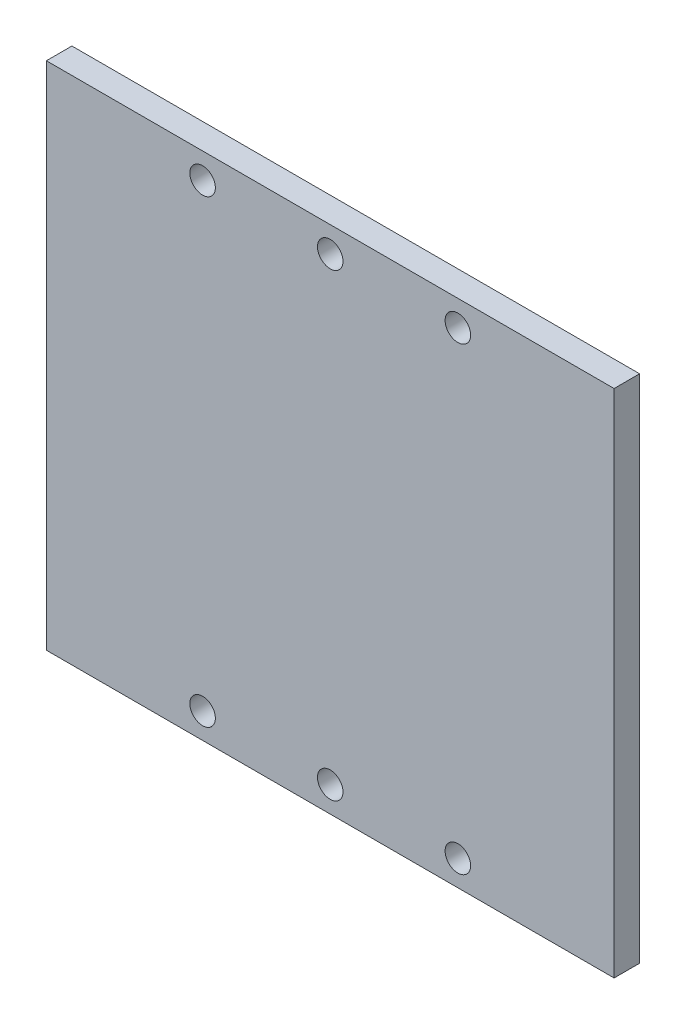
ISO-10303-21;
HEADER;
FILE_DESCRIPTION(('STEP AP214'),'2;1');
FILE_NAME('part.step','',(''),(''),'','','');
FILE_SCHEMA(('AUTOMOTIVE_DESIGN { 1 0 10303 214 1 1 1 1 }'));
ENDSEC;
DATA;
#1=APPLICATION_CONTEXT('core data for automotive mechanical design processes');
#2=APPLICATION_PROTOCOL_DEFINITION('international standard','automotive_design',2000,#1);
#3=PRODUCT_CONTEXT('',#1,'mechanical');
#4=PRODUCT('Part','Part','',(#3));
#5=PRODUCT_RELATED_PRODUCT_CATEGORY('part','',(#4));
#6=PRODUCT_DEFINITION_FORMATION('','',#4);
#7=PRODUCT_DEFINITION_CONTEXT('part definition',#1,'design');
#8=PRODUCT_DEFINITION('design','',#6,#7);
#9=PRODUCT_DEFINITION_SHAPE('','',#8);
#10=(LENGTH_UNIT() NAMED_UNIT(*) SI_UNIT(.MILLI.,.METRE.));
#11=(NAMED_UNIT(*) PLANE_ANGLE_UNIT() SI_UNIT($,.RADIAN.));
#12=(NAMED_UNIT(*) SI_UNIT($,.STERADIAN.) SOLID_ANGLE_UNIT());
#13=UNCERTAINTY_MEASURE_WITH_UNIT(LENGTH_MEASURE(1.E-05),#10,'distance_accuracy_value','');
#14=(GEOMETRIC_REPRESENTATION_CONTEXT(3) GLOBAL_UNCERTAINTY_ASSIGNED_CONTEXT((#13)) GLOBAL_UNIT_ASSIGNED_CONTEXT((#10,
#11,#12)) REPRESENTATION_CONTEXT('',''));
#15=CARTESIAN_POINT('',(0.,0.,0.));
#16=DIRECTION('',(0.,0.,1.));
#17=DIRECTION('',(1.,0.,0.));
#18=AXIS2_PLACEMENT_3D('',#15,#16,#17);
#19=CARTESIAN_POINT('',(0.,0.,2.));
#20=DIRECTION('',(0.,0.,1.));
#21=DIRECTION('',(1.,0.,0.));
#22=AXIS2_PLACEMENT_3D('',#19,#20,#21);
#23=PLANE('',#22);
#24=CARTESIAN_POINT('',(-8.26999999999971,3.00000000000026,2.));
#25=DIRECTION('',(0.,0.,1.));
#26=DIRECTION('',(-1.,0.,0.));
#27=AXIS2_PLACEMENT_3D('',#24,#25,#26);
#28=CIRCLE('',#27,1.);
#29=CARTESIAN_POINT('',(-9.26999999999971,3.00000000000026,2.));
#30=VERTEX_POINT('',#29);
#31=EDGE_CURVE('E165',#30,#30,#28,.T.);
#32=ORIENTED_EDGE('',*,*,#31,.F.);
#33=EDGE_LOOP('',(#32));
#34=FACE_BOUND('',#33,.T.);
#35=CARTESIAN_POINT('',(-18.2699999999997,-32.9999999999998,2.));
#36=DIRECTION('',(0.,0.,1.));
#37=DIRECTION('',(1.,0.,0.));
#38=AXIS2_PLACEMENT_3D('',#35,#36,#37);
#39=CIRCLE('',#38,1.);
#40=CARTESIAN_POINT('',(-17.2699999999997,-32.9999999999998,2.));
#41=VERTEX_POINT('',#40);
#42=EDGE_CURVE('E149',#41,#41,#39,.T.);
#43=ORIENTED_EDGE('',*,*,#42,.F.);
#44=EDGE_LOOP('',(#43));
#45=FACE_BOUND('',#44,.T.);
#46=CARTESIAN_POINT('',(-8.2699999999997,-32.9999999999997,2.));
#47=DIRECTION('',(0.,0.,1.));
#48=DIRECTION('',(1.,0.,0.));
#49=AXIS2_PLACEMENT_3D('',#46,#47,#48);
#50=CIRCLE('',#49,1.);
#51=CARTESIAN_POINT('',(-7.2699999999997,-32.9999999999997,2.));
#52=VERTEX_POINT('',#51);
#53=EDGE_CURVE('E117',#52,#52,#50,.T.);
#54=ORIENTED_EDGE('',*,*,#53,.F.);
#55=EDGE_LOOP('',(#54));
#56=FACE_BOUND('',#55,.T.);
#57=DIRECTION('',(0.,-1.,0.));
#58=VECTOR('',#57,1.);
#59=CARTESIAN_POINT('',(-30.5099999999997,5.00000000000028,2.));
#60=LINE('',#59,#58);
#61=CARTESIAN_POINT('',(-30.5099999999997,5.00000000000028,2.));
#62=VERTEX_POINT('',#61);
#63=CARTESIAN_POINT('',(-30.5099999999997,-34.9999999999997,2.));
#64=VERTEX_POINT('',#63);
#65=EDGE_CURVE('E96',#62,#64,#60,.T.);
#66=ORIENTED_EDGE('',*,*,#65,.T.);
#67=DIRECTION('',(1.,0.,0.));
#68=VECTOR('',#67,1.);
#69=CARTESIAN_POINT('',(-30.5099999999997,-34.9999999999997,2.));
#70=LINE('',#69,#68);
#71=CARTESIAN_POINT('',(13.9700000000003,-34.9999999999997,2.));
#72=VERTEX_POINT('',#71);
#73=EDGE_CURVE('E91',#64,#72,#70,.T.);
#74=ORIENTED_EDGE('',*,*,#73,.T.);
#75=DIRECTION('',(0.,1.,0.));
#76=VECTOR('',#75,1.);
#77=CARTESIAN_POINT('',(13.9700000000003,5.00000000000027,2.));
#78=LINE('',#77,#76);
#79=CARTESIAN_POINT('',(13.9700000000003,5.00000000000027,2.));
#80=VERTEX_POINT('',#79);
#81=EDGE_CURVE('E94',#72,#80,#78,.T.);
#82=ORIENTED_EDGE('',*,*,#81,.T.);
#83=DIRECTION('',(-1.,0.,0.));
#84=VECTOR('',#83,1.);
#85=CARTESIAN_POINT('',(-30.5099999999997,5.00000000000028,2.));
#86=LINE('',#85,#84);
#87=EDGE_CURVE('E61',#80,#62,#86,.T.);
#88=ORIENTED_EDGE('',*,*,#87,.T.);
#89=EDGE_LOOP('',(#66,#74,#82,#88));
#90=FACE_BOUND('',#89,.T.);
#91=CARTESIAN_POINT('',(1.7300000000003,-32.9999999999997,2.));
#92=DIRECTION('',(0.,0.,1.));
#93=DIRECTION('',(1.,0.,0.));
#94=AXIS2_PLACEMENT_3D('',#91,#92,#93);
#95=CIRCLE('',#94,1.);
#96=CARTESIAN_POINT('',(2.7300000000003,-32.9999999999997,2.));
#97=VERTEX_POINT('',#96);
#98=EDGE_CURVE('E141',#97,#97,#95,.T.);
#99=ORIENTED_EDGE('',*,*,#98,.F.);
#100=EDGE_LOOP('',(#99));
#101=FACE_BOUND('',#100,.T.);
#102=CARTESIAN_POINT('',(1.7300000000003,3.00000000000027,2.));
#103=DIRECTION('',(0.,0.,1.));
#104=DIRECTION('',(-1.,0.,0.));
#105=AXIS2_PLACEMENT_3D('',#102,#103,#104);
#106=CIRCLE('',#105,1.);
#107=CARTESIAN_POINT('',(0.730000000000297,3.00000000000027,2.));
#108=VERTEX_POINT('',#107);
#109=EDGE_CURVE('E157',#108,#108,#106,.T.);
#110=ORIENTED_EDGE('',*,*,#109,.F.);
#111=EDGE_LOOP('',(#110));
#112=FACE_BOUND('',#111,.T.);
#113=CARTESIAN_POINT('',(-18.2699999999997,3.00000000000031,2.));
#114=DIRECTION('',(0.,0.,1.));
#115=DIRECTION('',(-1.,0.,0.));
#116=AXIS2_PLACEMENT_3D('',#113,#114,#115);
#117=CIRCLE('',#116,1.);
#118=CARTESIAN_POINT('',(-19.2699999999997,3.00000000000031,2.));
#119=VERTEX_POINT('',#118);
#120=EDGE_CURVE('E173',#119,#119,#117,.T.);
#121=ORIENTED_EDGE('',*,*,#120,.F.);
#122=EDGE_LOOP('',(#121));
#123=FACE_BOUND('',#122,.T.);
#124=ADVANCED_FACE('F43',(#34,#45,#56,#90,#101,#112,#123),#23,.T.);
#125=CARTESIAN_POINT('',(0.,0.,0.));
#126=DIRECTION('',(0.,0.,1.));
#127=DIRECTION('',(1.,0.,0.));
#128=AXIS2_PLACEMENT_3D('',#125,#126,#127);
#129=PLANE('',#128);
#130=DIRECTION('',(0.,-1.,0.));
#131=VECTOR('',#130,1.);
#132=CARTESIAN_POINT('',(-30.5099999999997,5.00000000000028,0.));
#133=LINE('',#132,#131);
#134=CARTESIAN_POINT('',(-30.5099999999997,5.00000000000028,0.));
#135=VERTEX_POINT('',#134);
#136=CARTESIAN_POINT('',(-30.5099999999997,-34.9999999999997,0.));
#137=VERTEX_POINT('',#136);
#138=EDGE_CURVE('E113',#135,#137,#133,.T.);
#139=ORIENTED_EDGE('',*,*,#138,.F.);
#140=DIRECTION('',(-1.,0.,0.));
#141=VECTOR('',#140,1.);
#142=CARTESIAN_POINT('',(-30.5099999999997,5.00000000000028,0.));
#143=LINE('',#142,#141);
#144=CARTESIAN_POINT('',(13.9700000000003,5.00000000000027,0.));
#145=VERTEX_POINT('',#144);
#146=EDGE_CURVE('E84',#145,#135,#143,.T.);
#147=ORIENTED_EDGE('',*,*,#146,.F.);
#148=DIRECTION('',(0.,1.,0.));
#149=VECTOR('',#148,1.);
#150=CARTESIAN_POINT('',(13.9700000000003,5.00000000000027,0.));
#151=LINE('',#150,#149);
#152=CARTESIAN_POINT('',(13.9700000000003,-34.9999999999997,0.));
#153=VERTEX_POINT('',#152);
#154=EDGE_CURVE('E78',#153,#145,#151,.T.);
#155=ORIENTED_EDGE('',*,*,#154,.F.);
#156=DIRECTION('',(1.,0.,0.));
#157=VECTOR('',#156,1.);
#158=CARTESIAN_POINT('',(-30.5099999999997,-34.9999999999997,0.));
#159=LINE('',#158,#157);
#160=EDGE_CURVE('E101',#137,#153,#159,.T.);
#161=ORIENTED_EDGE('',*,*,#160,.F.);
#162=EDGE_LOOP('',(#139,#147,#155,#161));
#163=FACE_BOUND('',#162,.T.);
#164=CARTESIAN_POINT('',(-8.2699999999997,-32.9999999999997,0.));
#165=DIRECTION('',(0.,0.,1.));
#166=DIRECTION('',(1.,0.,0.));
#167=AXIS2_PLACEMENT_3D('',#164,#165,#166);
#168=CIRCLE('',#167,1.);
#169=CARTESIAN_POINT('',(-7.2699999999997,-32.9999999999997,0.));
#170=VERTEX_POINT('',#169);
#171=EDGE_CURVE('E137',#170,#170,#168,.T.);
#172=ORIENTED_EDGE('',*,*,#171,.T.);
#173=EDGE_LOOP('',(#172));
#174=FACE_BOUND('',#173,.T.);
#175=CARTESIAN_POINT('',(1.7300000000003,-32.9999999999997,0.));
#176=DIRECTION('',(0.,0.,1.));
#177=DIRECTION('',(1.,0.,0.));
#178=AXIS2_PLACEMENT_3D('',#175,#176,#177);
#179=CIRCLE('',#178,1.);
#180=CARTESIAN_POINT('',(2.7300000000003,-32.9999999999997,0.));
#181=VERTEX_POINT('',#180);
#182=EDGE_CURVE('E145',#181,#181,#179,.T.);
#183=ORIENTED_EDGE('',*,*,#182,.T.);
#184=EDGE_LOOP('',(#183));
#185=FACE_BOUND('',#184,.T.);
#186=CARTESIAN_POINT('',(-18.2699999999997,-32.9999999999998,0.));
#187=DIRECTION('',(0.,0.,1.));
#188=DIRECTION('',(1.,0.,0.));
#189=AXIS2_PLACEMENT_3D('',#186,#187,#188);
#190=CIRCLE('',#189,1.);
#191=CARTESIAN_POINT('',(-17.2699999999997,-32.9999999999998,0.));
#192=VERTEX_POINT('',#191);
#193=EDGE_CURVE('E153',#192,#192,#190,.T.);
#194=ORIENTED_EDGE('',*,*,#193,.T.);
#195=EDGE_LOOP('',(#194));
#196=FACE_BOUND('',#195,.T.);
#197=CARTESIAN_POINT('',(1.7300000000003,3.00000000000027,0.));
#198=DIRECTION('',(0.,0.,1.));
#199=DIRECTION('',(-1.,0.,0.));
#200=AXIS2_PLACEMENT_3D('',#197,#198,#199);
#201=CIRCLE('',#200,1.);
#202=CARTESIAN_POINT('',(0.730000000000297,3.00000000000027,0.));
#203=VERTEX_POINT('',#202);
#204=EDGE_CURVE('E161',#203,#203,#201,.T.);
#205=ORIENTED_EDGE('',*,*,#204,.T.);
#206=EDGE_LOOP('',(#205));
#207=FACE_BOUND('',#206,.T.);
#208=CARTESIAN_POINT('',(-8.26999999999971,3.00000000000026,0.));
#209=DIRECTION('',(0.,0.,1.));
#210=DIRECTION('',(-1.,0.,0.));
#211=AXIS2_PLACEMENT_3D('',#208,#209,#210);
#212=CIRCLE('',#211,1.);
#213=CARTESIAN_POINT('',(-9.26999999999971,3.00000000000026,0.));
#214=VERTEX_POINT('',#213);
#215=EDGE_CURVE('E169',#214,#214,#212,.T.);
#216=ORIENTED_EDGE('',*,*,#215,.T.);
#217=EDGE_LOOP('',(#216));
#218=FACE_BOUND('',#217,.T.);
#219=CARTESIAN_POINT('',(-18.2699999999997,3.00000000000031,0.));
#220=DIRECTION('',(0.,0.,1.));
#221=DIRECTION('',(-1.,0.,0.));
#222=AXIS2_PLACEMENT_3D('',#219,#220,#221);
#223=CIRCLE('',#222,1.);
#224=CARTESIAN_POINT('',(-19.2699999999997,3.00000000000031,0.));
#225=VERTEX_POINT('',#224);
#226=EDGE_CURVE('E177',#225,#225,#223,.T.);
#227=ORIENTED_EDGE('',*,*,#226,.T.);
#228=EDGE_LOOP('',(#227));
#229=FACE_BOUND('',#228,.T.);
#230=ADVANCED_FACE('F131',(#163,#174,#185,#196,#207,#218,#229),#129,.F.);
#231=CARTESIAN_POINT('',(-30.5099999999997,5.00000000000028,2.));
#232=DIRECTION('',(1.,0.,0.));
#233=DIRECTION('',(0.,1.,0.));
#234=AXIS2_PLACEMENT_3D('',#231,#232,#233);
#235=PLANE('',#234);
#236=ORIENTED_EDGE('',*,*,#138,.T.);
#237=DIRECTION('',(0.,0.,-1.));
#238=VECTOR('',#237,1.);
#239=CARTESIAN_POINT('',(-30.5099999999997,-34.9999999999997,2.));
#240=LINE('',#239,#238);
#241=EDGE_CURVE('E11',#64,#137,#240,.T.);
#242=ORIENTED_EDGE('',*,*,#241,.F.);
#243=ORIENTED_EDGE('',*,*,#65,.F.);
#244=DIRECTION('',(0.,0.,-1.));
#245=VECTOR('',#244,1.);
#246=CARTESIAN_POINT('',(-30.5099999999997,5.00000000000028,2.));
#247=LINE('',#246,#245);
#248=EDGE_CURVE('E109',#62,#135,#247,.T.);
#249=ORIENTED_EDGE('',*,*,#248,.T.);
#250=EDGE_LOOP('',(#236,#242,#243,#249));
#251=FACE_BOUND('',#250,.T.);
#252=ADVANCED_FACE('F45',(#251),#235,.F.);
#253=CARTESIAN_POINT('',(-30.5099999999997,-34.9999999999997,2.));
#254=DIRECTION('',(0.,1.,0.));
#255=DIRECTION('',(-1.,0.,0.));
#256=AXIS2_PLACEMENT_3D('',#253,#254,#255);
#257=PLANE('',#256);
#258=ORIENTED_EDGE('',*,*,#160,.T.);
#259=DIRECTION('',(0.,0.,-1.));
#260=VECTOR('',#259,1.);
#261=CARTESIAN_POINT('',(13.9700000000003,-34.9999999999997,2.));
#262=LINE('',#261,#260);
#263=EDGE_CURVE('E53',#72,#153,#262,.T.);
#264=ORIENTED_EDGE('',*,*,#263,.F.);
#265=ORIENTED_EDGE('',*,*,#73,.F.);
#266=ORIENTED_EDGE('',*,*,#241,.T.);
#267=EDGE_LOOP('',(#258,#264,#265,#266));
#268=FACE_BOUND('',#267,.T.);
#269=ADVANCED_FACE('F100',(#268),#257,.F.);
#270=CARTESIAN_POINT('',(13.9700000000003,5.00000000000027,2.));
#271=DIRECTION('',(-1.,0.,0.));
#272=DIRECTION('',(0.,-1.,0.));
#273=AXIS2_PLACEMENT_3D('',#270,#271,#272);
#274=PLANE('',#273);
#275=ORIENTED_EDGE('',*,*,#154,.T.);
#276=DIRECTION('',(0.,0.,-1.));
#277=VECTOR('',#276,1.);
#278=CARTESIAN_POINT('',(13.9700000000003,5.00000000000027,2.));
#279=LINE('',#278,#277);
#280=EDGE_CURVE('E103',#80,#145,#279,.T.);
#281=ORIENTED_EDGE('',*,*,#280,.F.);
#282=ORIENTED_EDGE('',*,*,#81,.F.);
#283=ORIENTED_EDGE('',*,*,#263,.T.);
#284=EDGE_LOOP('',(#275,#281,#282,#283));
#285=FACE_BOUND('',#284,.T.);
#286=ADVANCED_FACE('F104',(#285),#274,.F.);
#287=CARTESIAN_POINT('',(-30.5099999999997,5.00000000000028,2.));
#288=DIRECTION('',(0.,-1.,0.));
#289=DIRECTION('',(1.,0.,0.));
#290=AXIS2_PLACEMENT_3D('',#287,#288,#289);
#291=PLANE('',#290);
#292=ORIENTED_EDGE('',*,*,#146,.T.);
#293=ORIENTED_EDGE('',*,*,#248,.F.);
#294=ORIENTED_EDGE('',*,*,#87,.F.);
#295=ORIENTED_EDGE('',*,*,#280,.T.);
#296=EDGE_LOOP('',(#292,#293,#294,#295));
#297=FACE_BOUND('',#296,.T.);
#298=ADVANCED_FACE('F128',(#297),#291,.F.);
#299=CARTESIAN_POINT('',(-8.2699999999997,-32.9999999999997,2.));
#300=DIRECTION('',(0.,0.,-1.));
#301=DIRECTION('',(-1.,0.,0.));
#302=AXIS2_PLACEMENT_3D('',#299,#300,#301);
#303=CYLINDRICAL_SURFACE('',#302,1.);
#304=ORIENTED_EDGE('',*,*,#53,.T.);
#305=EDGE_LOOP('',(#304));
#306=FACE_BOUND('',#305,.T.);
#307=ORIENTED_EDGE('',*,*,#171,.F.);
#308=EDGE_LOOP('',(#307));
#309=FACE_BOUND('',#308,.T.);
#310=ADVANCED_FACE('F199',(#306,#309),#303,.F.);
#311=CARTESIAN_POINT('',(1.7300000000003,-32.9999999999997,2.));
#312=DIRECTION('',(0.,0.,-1.));
#313=DIRECTION('',(-1.,0.,0.));
#314=AXIS2_PLACEMENT_3D('',#311,#312,#313);
#315=CYLINDRICAL_SURFACE('',#314,1.);
#316=ORIENTED_EDGE('',*,*,#98,.T.);
#317=EDGE_LOOP('',(#316));
#318=FACE_BOUND('',#317,.T.);
#319=ORIENTED_EDGE('',*,*,#182,.F.);
#320=EDGE_LOOP('',(#319));
#321=FACE_BOUND('',#320,.T.);
#322=ADVANCED_FACE('F244',(#318,#321),#315,.F.);
#323=CARTESIAN_POINT('',(-18.2699999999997,-32.9999999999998,2.));
#324=DIRECTION('',(0.,0.,-1.));
#325=DIRECTION('',(-1.,0.,0.));
#326=AXIS2_PLACEMENT_3D('',#323,#324,#325);
#327=CYLINDRICAL_SURFACE('',#326,1.);
#328=ORIENTED_EDGE('',*,*,#42,.T.);
#329=EDGE_LOOP('',(#328));
#330=FACE_BOUND('',#329,.T.);
#331=ORIENTED_EDGE('',*,*,#193,.F.);
#332=EDGE_LOOP('',(#331));
#333=FACE_BOUND('',#332,.T.);
#334=ADVANCED_FACE('F252',(#330,#333),#327,.F.);
#335=CARTESIAN_POINT('',(1.7300000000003,3.00000000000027,2.));
#336=DIRECTION('',(0.,0.,-1.));
#337=DIRECTION('',(-1.,0.,0.));
#338=AXIS2_PLACEMENT_3D('',#335,#336,#337);
#339=CYLINDRICAL_SURFACE('',#338,1.);
#340=ORIENTED_EDGE('',*,*,#109,.T.);
#341=EDGE_LOOP('',(#340));
#342=FACE_BOUND('',#341,.T.);
#343=ORIENTED_EDGE('',*,*,#204,.F.);
#344=EDGE_LOOP('',(#343));
#345=FACE_BOUND('',#344,.T.);
#346=ADVANCED_FACE('F260',(#342,#345),#339,.F.);
#347=CARTESIAN_POINT('',(-8.26999999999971,3.00000000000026,2.));
#348=DIRECTION('',(0.,0.,-1.));
#349=DIRECTION('',(-1.,0.,0.));
#350=AXIS2_PLACEMENT_3D('',#347,#348,#349);
#351=CYLINDRICAL_SURFACE('',#350,1.);
#352=ORIENTED_EDGE('',*,*,#31,.T.);
#353=EDGE_LOOP('',(#352));
#354=FACE_BOUND('',#353,.T.);
#355=ORIENTED_EDGE('',*,*,#215,.F.);
#356=EDGE_LOOP('',(#355));
#357=FACE_BOUND('',#356,.T.);
#358=ADVANCED_FACE('F269',(#354,#357),#351,.F.);
#359=CARTESIAN_POINT('',(-18.2699999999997,3.00000000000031,2.));
#360=DIRECTION('',(0.,0.,-1.));
#361=DIRECTION('',(-1.,0.,0.));
#362=AXIS2_PLACEMENT_3D('',#359,#360,#361);
#363=CYLINDRICAL_SURFACE('',#362,1.);
#364=ORIENTED_EDGE('',*,*,#120,.T.);
#365=EDGE_LOOP('',(#364));
#366=FACE_BOUND('',#365,.T.);
#367=ORIENTED_EDGE('',*,*,#226,.F.);
#368=EDGE_LOOP('',(#367));
#369=FACE_BOUND('',#368,.T.);
#370=ADVANCED_FACE('F186',(#366,#369),#363,.F.);
#371=CLOSED_SHELL('',(#124,#230,#252,#269,#286,#298,#310,#322,#334,#346,#358,#370));
#372=MANIFOLD_SOLID_BREP('B2',#371);
#373=ADVANCED_BREP_SHAPE_REPRESENTATION('',(#18,#372),#14);
#374=SHAPE_DEFINITION_REPRESENTATION(#9,#373);
ENDSEC;
END-ISO-10303-21;
